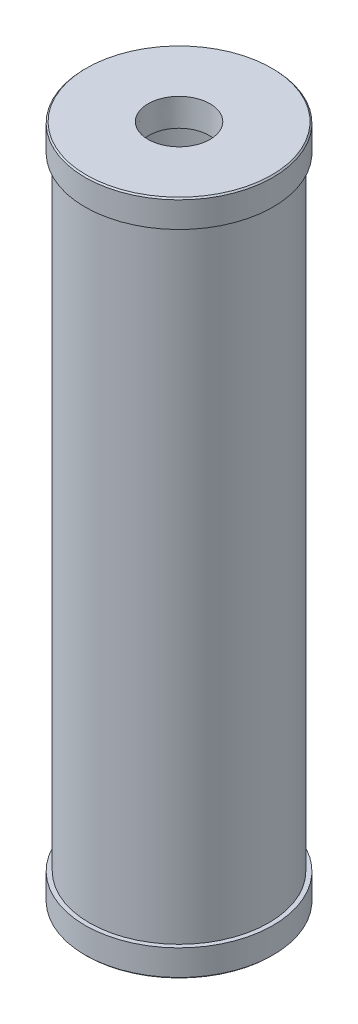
from build123d import *

# Parameters (mm, degrees)
SKETCH1_R           = 84.201
SKETCH1_R_2         = 74.676
BOSS_EXTRUDE1_DEPTH = 635
SKETCH2_R           = 88.265
BOSS_EXTRUDE2_DEPTH = 25.4
BOSS_EXTRUDE3_START = -25.4
SKETCH3_R           = 88.265
BOSS_EXTRUDE3_DEPTH = 25.4
CHAMFER1_SIZE       = 1.27


with BuildPart() as part:
    # Sketch1 → Boss-Extrude1 (new body)
    with BuildSketch(Plane(origin=(0, 0, 0), x_dir=(1, 0, 0), z_dir=(0, 1, 0))):
        with Locations(Location((0, 0, 0), (0, 0, 90))):
            Circle(SKETCH1_R)
        with Locations(Location((0, 0, 0), (0, 0, 90))):
            Circle(SKETCH1_R_2, mode=Mode.SUBTRACT)
    extrude(amount=BOSS_EXTRUDE1_DEPTH)

    # Sketch2 → Boss-Extrude2 (add)
    with BuildSketch(Plane(origin=(0, 0, 0), x_dir=(1, 0, 0), z_dir=(0, 1, 0))):
        with Locations(Location((0, 0, 0), (0, 0, 270))):
            Circle(SKETCH2_R)
    extrude(amount=BOSS_EXTRUDE2_DEPTH)

    # Sketch3 → Boss-Extrude3 (add)
    with BuildSketch(Plane(origin=(0, 635, 0), x_dir=(1, 0, 0), z_dir=(0, 1, 0)).offset(BOSS_EXTRUDE3_START)):
        with Locations(Location((0, 0, 0), (0, 0, 270))):
            Circle(SKETCH3_R)
    extrude(amount=BOSS_EXTRUDE3_DEPTH)

    # Sketch4 → 2 Rc Tapped Hole1 (revolve, cut)
    with BuildSketch(Plane(origin=(0, 635, 0), x_dir=(0, 0, 1), z_dir=(1, 0, 0))):
        Polygon((0, 0), (0, 53.547580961), (27.4, 37.084), (27.4, 25.654), (28.265232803, 25.654), (29.066064, 0), align=None)
    revolve(axis=Axis((0, 641.35, 0), (0, -1, 0)), mode=Mode.SUBTRACT)

    # Sketch10 → 2 Rc Tapped Hole2 (revolve, cut)
    with BuildSketch(Plane(origin=(0, 0, 0), x_dir=(0, 0, -1), z_dir=(1, 0, 0))):
        Polygon((0, 0), (0, 53.547580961), (27.4, 37.084), (27.4, 25.654), (28.265232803, 25.654), (29.066064, 0), align=None)
    revolve(axis=Axis((0, -6.35, 0), (0, 1, 0)), mode=Mode.SUBTRACT)

    # Chamfer1
    chamfer1_edges = [part.edges().sort_by_distance(p)[0] for p in [
        (0, 0, -88.265),
        (0, 635, -88.265),
    ]]
    chamfer(chamfer1_edges, length=CHAMFER1_SIZE)


solid = part.part
